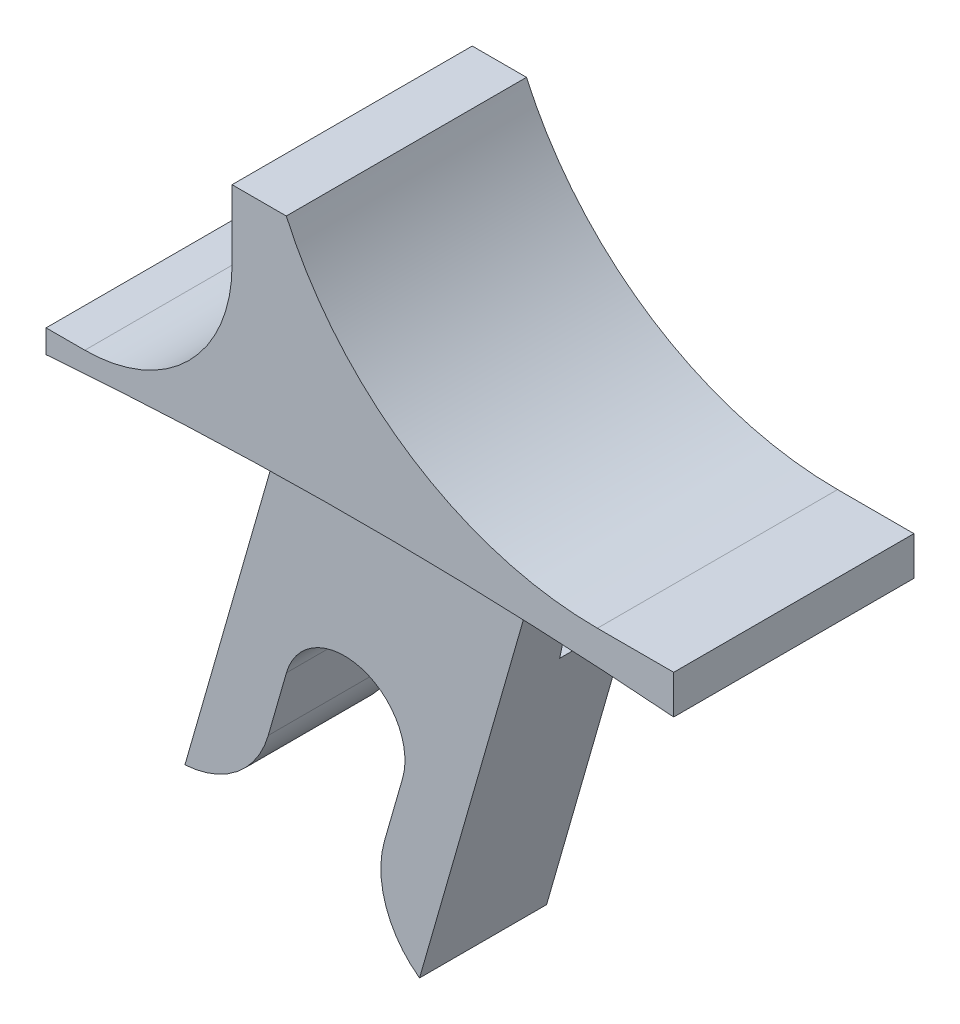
from build123d import *

# Parameters (mm, degrees)
BOSS_EXTRUDE1_DEPTH = 3.937
BOSS_EXTRUDE2_DEPTH = 2.0828
CUT_EXTRUDE1_DEPTH  = 1.4097


with BuildPart() as part:
    # Sketch1 → Boss-Extrude1 (new, symmetric)
    with BuildSketch(Plane.XY):
        with BuildLine():
            Line((-12.7, 7.874), (-14.478, 7.874))
            Line((-14.478, 7.874), (-14.478, 5.588))
            ThreePointArc((-14.478, 5.588), (-15.891502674, 2.175502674), (-19.304, 0.762))
            Line((-19.304, 0.762), (-20.574, 0.762))
            Line((-20.574, 0.762), (-20.574, 0))
            ThreePointArc((-20.574, 0), (-10.287, 0.404328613), (0, 0))
            Line((0, 0), (0, 1.27))
            Line((0, 1.27), (-2.501971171, 1.27))
            ThreePointArc((-2.501971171, 1.27), (-8.576767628, 3.065177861), (-12.7, 7.874))
        make_face()
    extrude(amount=BOSS_EXTRUDE1_DEPTH, both=True)

    # Sketch2 → Boss-Extrude2 (add, symmetric)
    with BuildSketch(Plane.XY):
        with BuildLine():
            Line((-10.186121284, -13.428825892), (-6.137299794, 0.691092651))
            Line((-6.137299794, 0.691092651), (-14.460735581, 0.691092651))
            Line((-14.460735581, 0.691092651), (-17.877176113, -11.223451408))
            ThreePointArc((-17.877176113, -11.223451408), (-16.162707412, -10.555232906), (-15.145252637, -9.022032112))
            Line((-15.145252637, -9.022032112), (-14.550220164, -6.946907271))
            ThreePointArc((-14.550220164, -6.946907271), (-12.370038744, -5.531080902), (-10.664568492, -7.493))
            ThreePointArc((-10.664568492, -7.493), (-10.683849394, -7.768729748), (-10.74131682, -8.039092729))
            Line((-10.74131682, -8.039092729), (-11.336349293, -10.11421757))
            ThreePointArc((-11.336349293, -10.11421757), (-11.285971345, -11.953614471), (-10.186121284, -13.428825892))
        make_face()
    extrude(amount=BOSS_EXTRUDE2_DEPTH, both=True)

    # Sketch4 → Cut-Extrude1 (cut, symmetric)
    with BuildSketch(Plane(origin=(0, -2.5146, 0), x_dir=(1, 0, 0), z_dir=(0, 1, 0))):
        Polygon((-11.607302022, 1.2954), (-17.957302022, -1.015810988), (-17.957302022, 2.8194), (-5.257302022, 2.8194), (-5.257302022, -1.015810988), align=None)
    extrude(amount=CUT_EXTRUDE1_DEPTH, both=True, mode=Mode.SUBTRACT)


solid = part.part
